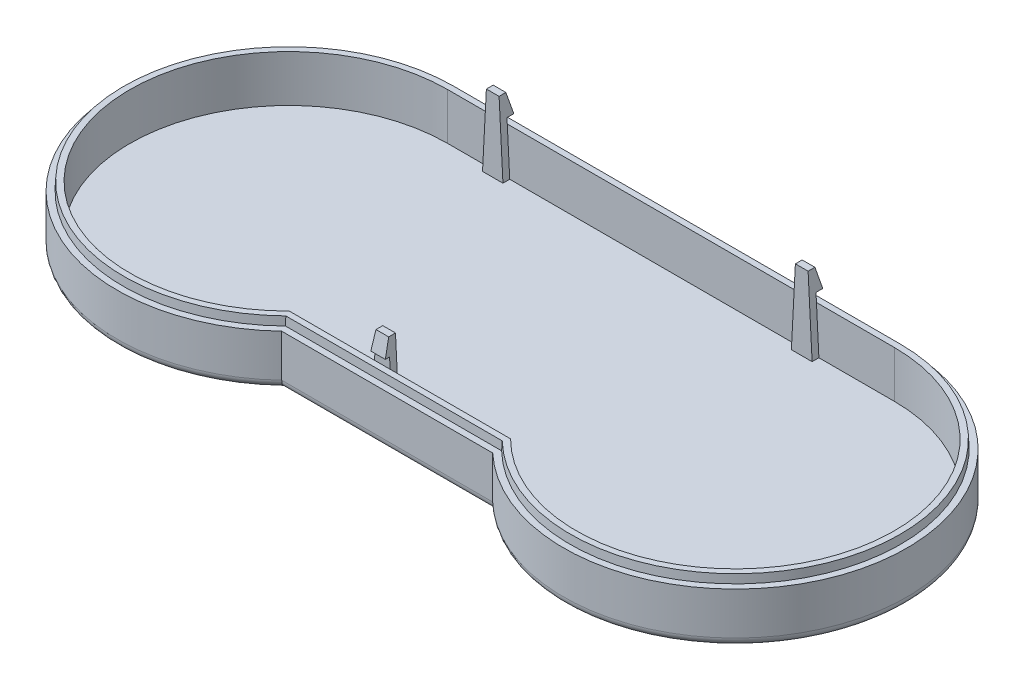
ISO-10303-21;
HEADER;
FILE_DESCRIPTION(('STEP AP214'),'2;1');
FILE_NAME('part.step','',(''),(''),'','','');
FILE_SCHEMA(('AUTOMOTIVE_DESIGN { 1 0 10303 214 1 1 1 1 }'));
ENDSEC;
DATA;
#1=APPLICATION_CONTEXT('core data for automotive mechanical design processes');
#2=APPLICATION_PROTOCOL_DEFINITION('international standard','automotive_design',2000,#1);
#3=PRODUCT_CONTEXT('',#1,'mechanical');
#4=PRODUCT('Part','Part','',(#3));
#5=PRODUCT_RELATED_PRODUCT_CATEGORY('part','',(#4));
#6=PRODUCT_DEFINITION_FORMATION('','',#4);
#7=PRODUCT_DEFINITION_CONTEXT('part definition',#1,'design');
#8=PRODUCT_DEFINITION('design','',#6,#7);
#9=PRODUCT_DEFINITION_SHAPE('','',#8);
#10=(LENGTH_UNIT() NAMED_UNIT(*) SI_UNIT(.MILLI.,.METRE.));
#11=(NAMED_UNIT(*) PLANE_ANGLE_UNIT() SI_UNIT($,.RADIAN.));
#12=(NAMED_UNIT(*) SI_UNIT($,.STERADIAN.) SOLID_ANGLE_UNIT());
#13=UNCERTAINTY_MEASURE_WITH_UNIT(LENGTH_MEASURE(1.E-05),#10,'distance_accuracy_value','');
#14=(GEOMETRIC_REPRESENTATION_CONTEXT(3) GLOBAL_UNCERTAINTY_ASSIGNED_CONTEXT((#13)) GLOBAL_UNIT_ASSIGNED_CONTEXT((#10,
#11,#12)) REPRESENTATION_CONTEXT('',''));
#15=CARTESIAN_POINT('',(0.,0.,0.));
#16=DIRECTION('',(0.,0.,1.));
#17=DIRECTION('',(1.,0.,0.));
#18=AXIS2_PLACEMENT_3D('',#15,#16,#17);
#19=CARTESIAN_POINT('',(-66.8305917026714,15.24,-47.5654461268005));
#20=DIRECTION('',(0.,0.,1.));
#21=DIRECTION('',(1.,0.,0.));
#22=AXIS2_PLACEMENT_3D('',#19,#20,#21);
#23=PLANE('',#22);
#24=DIRECTION('',(-0.0523359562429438,-0.998629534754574,0.));
#25=VECTOR('',#24,1.);
#26=CARTESIAN_POINT('',(-53.2218141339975,25.742282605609,-47.5654461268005));
#27=LINE('',#26,#25);
#28=CARTESIAN_POINT('',(-53.6390996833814,17.78,-47.5654461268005));
#29=VERTEX_POINT('',#28);
#30=CARTESIAN_POINT('',(-54.3712363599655,3.81,-47.5654461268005));
#31=VERTEX_POINT('',#30);
#32=EDGE_CURVE('E105',#29,#31,#27,.T.);
#33=ORIENTED_EDGE('',*,*,#32,.F.);
#34=DIRECTION('',(-1.,0.,0.));
#35=VECTOR('',#34,1.);
#36=CARTESIAN_POINT('',(-66.8305917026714,17.78,-47.5654461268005));
#37=LINE('',#36,#35);
#38=CARTESIAN_POINT('',(-66.8305917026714,17.78,-47.5654461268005));
#39=VERTEX_POINT('',#38);
#40=EDGE_CURVE('E528',#29,#39,#37,.T.);
#41=ORIENTED_EDGE('',*,*,#40,.T.);
#42=DIRECTION('',(0.,-1.,0.));
#43=VECTOR('',#42,1.);
#44=CARTESIAN_POINT('',(-66.8305917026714,15.24,-47.5654461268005));
#45=LINE('',#44,#43);
#46=CARTESIAN_POINT('',(-66.8305917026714,3.81,-47.5654461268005));
#47=VERTEX_POINT('',#46);
#48=EDGE_CURVE('E750',#39,#47,#45,.T.);
#49=ORIENTED_EDGE('',*,*,#48,.T.);
#50=DIRECTION('',(-1.,0.,0.));
#51=VECTOR('',#50,1.);
#52=CARTESIAN_POINT('',(-66.8305917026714,3.81,-47.5654461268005));
#53=LINE('',#52,#51);
#54=EDGE_CURVE('E330',#31,#47,#53,.T.);
#55=ORIENTED_EDGE('',*,*,#54,.F.);
#56=EDGE_LOOP('',(#33,#41,#49,#55));
#57=FACE_BOUND('',#56,.T.);
#58=ADVANCED_FACE('F88',(#57),#23,.T.);
#59=CARTESIAN_POINT('',(31.5685648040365,15.24,33.5534302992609));
#60=DIRECTION('',(0.,0.,-1.));
#61=DIRECTION('',(-1.,0.,0.));
#62=AXIS2_PLACEMENT_3D('',#59,#60,#61);
#63=PLANE('',#62);
#64=DIRECTION('',(0.0523359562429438,-0.998629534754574,0.));
#65=VECTOR('',#64,1.);
#66=CARTESIAN_POINT('',(-2.71383610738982,13.4433354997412,33.5534302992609));
#67=LINE('',#66,#65);
#68=CARTESIAN_POINT('',(-2.94111106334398,17.78,33.5534302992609));
#69=VERTEX_POINT('',#68);
#70=CARTESIAN_POINT('',(-2.20897438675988,3.81,33.5534302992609));
#71=VERTEX_POINT('',#70);
#72=EDGE_CURVE('E13',#69,#71,#67,.T.);
#73=ORIENTED_EDGE('',*,*,#72,.F.);
#74=DIRECTION('',(1.,0.,0.));
#75=VECTOR('',#74,1.);
#76=CARTESIAN_POINT('',(31.5685648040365,17.78,33.5534302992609));
#77=LINE('',#76,#75);
#78=CARTESIAN_POINT('',(33.1165148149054,17.78,33.5534302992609));
#79=VERTEX_POINT('',#78);
#80=EDGE_CURVE('E532',#69,#79,#77,.T.);
#81=ORIENTED_EDGE('',*,*,#80,.T.);
#82=DIRECTION('',(0.,-1.,0.));
#83=VECTOR('',#82,1.);
#84=CARTESIAN_POINT('',(33.1165148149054,15.24,33.5534302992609));
#85=LINE('',#84,#83);
#86=CARTESIAN_POINT('',(33.1165148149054,3.81,33.5534302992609));
#87=VERTEX_POINT('',#86);
#88=EDGE_CURVE('E744',#79,#87,#85,.T.);
#89=ORIENTED_EDGE('',*,*,#88,.T.);
#90=DIRECTION('',(1.,0.,0.));
#91=VECTOR('',#90,1.);
#92=CARTESIAN_POINT('',(31.5685648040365,3.81,33.5534302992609));
#93=LINE('',#92,#91);
#94=EDGE_CURVE('E745',#71,#87,#93,.T.);
#95=ORIENTED_EDGE('',*,*,#94,.F.);
#96=EDGE_LOOP('',(#73,#81,#89,#95));
#97=FACE_BOUND('',#96,.T.);
#98=ADVANCED_FACE('F610',(#97),#63,.T.);
#99=DIRECTION('',(-0.0523359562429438,0.998629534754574,0.));
#100=VECTOR('',#99,1.);
#101=CARTESIAN_POINT('',(-49.4118141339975,25.742282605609,-47.5654461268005));
#102=LINE('',#101,#100);
#103=CARTESIAN_POINT('',(-48.2623919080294,3.81,-47.5654461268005));
#104=VERTEX_POINT('',#103);
#105=CARTESIAN_POINT('',(-48.9945285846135,17.78,-47.5654461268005));
#106=VERTEX_POINT('',#105);
#107=EDGE_CURVE('E333',#104,#106,#102,.T.);
#108=ORIENTED_EDGE('',*,*,#107,.F.);
#109=CARTESIAN_POINT('',(38.0629201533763,3.81,-47.5654461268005));
#110=VERTEX_POINT('',#109);
#111=EDGE_CURVE('E318',#110,#104,#53,.T.);
#112=ORIENTED_EDGE('',*,*,#111,.F.);
#113=DIRECTION('',(-0.0523359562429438,-0.998629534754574,0.));
#114=VECTOR('',#113,1.);
#115=CARTESIAN_POINT('',(38.3729915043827,9.72651383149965,-47.5654461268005));
#116=LINE('',#115,#114);
#117=CARTESIAN_POINT('',(38.7950568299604,17.78,-47.5654461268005));
#118=VERTEX_POINT('',#117);
#119=EDGE_CURVE('E98',#118,#110,#116,.T.);
#120=ORIENTED_EDGE('',*,*,#119,.F.);
#121=EDGE_CURVE('E335',#118,#106,#37,.T.);
#122=ORIENTED_EDGE('',*,*,#121,.T.);
#123=EDGE_LOOP('',(#108,#112,#120,#122));
#124=FACE_BOUND('',#123,.T.);
#125=ADVANCED_FACE('F334',(#124),#23,.T.);
#126=CARTESIAN_POINT('',(66.8305917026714,15.24,0.));
#127=DIRECTION('',(0.,-1.,0.));
#128=DIRECTION('',(0.,0.,-1.));
#129=AXIS2_PLACEMENT_3D('',#126,#127,#128);
#130=CYLINDRICAL_SURFACE('',#129,51.3754461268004);
#131=DIRECTION('',(0.,-1.,0.));
#132=VECTOR('',#131,1.);
#133=CARTESIAN_POINT('',(31.5685648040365,15.24,37.3634302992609));
#134=LINE('',#133,#132);
#135=CARTESIAN_POINT('',(31.5685648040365,15.24,37.3634302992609));
#136=VERTEX_POINT('',#135);
#137=CARTESIAN_POINT('',(31.5685648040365,2.54,37.3634302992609));
#138=VERTEX_POINT('',#137);
#139=EDGE_CURVE('E723',#136,#138,#134,.T.);
#140=ORIENTED_EDGE('',*,*,#139,.T.);
#141=CARTESIAN_POINT('',(66.8305917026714,2.54,0.));
#142=DIRECTION('',(0.,1.,0.));
#143=DIRECTION('',(0.,0.,1.));
#144=AXIS2_PLACEMENT_3D('',#141,#142,#143);
#145=CIRCLE('',#144,51.3754461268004);
#146=CARTESIAN_POINT('',(66.8305917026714,2.54,-51.3754461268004));
#147=VERTEX_POINT('',#146);
#148=EDGE_CURVE('E668',#138,#147,#145,.T.);
#149=ORIENTED_EDGE('',*,*,#148,.T.);
#150=DIRECTION('',(0.,-1.,0.));
#151=VECTOR('',#150,1.);
#152=CARTESIAN_POINT('',(66.8305917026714,15.24,-51.3754461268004));
#153=LINE('',#152,#151);
#154=CARTESIAN_POINT('',(66.8305917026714,15.24,-51.3754461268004));
#155=VERTEX_POINT('',#154);
#156=EDGE_CURVE('E712',#155,#147,#153,.T.);
#157=ORIENTED_EDGE('',*,*,#156,.F.);
#158=CARTESIAN_POINT('',(66.8305917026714,15.24,0.));
#159=DIRECTION('',(0.,1.,0.));
#160=DIRECTION('',(0.,0.,1.));
#161=AXIS2_PLACEMENT_3D('',#158,#159,#160);
#162=CIRCLE('',#161,51.3754461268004);
#163=EDGE_CURVE('E735',#136,#155,#162,.T.);
#164=ORIENTED_EDGE('',*,*,#163,.F.);
#165=EDGE_LOOP('',(#140,#149,#157,#164));
#166=FACE_BOUND('',#165,.T.);
#167=ADVANCED_FACE('F633',(#166),#130,.T.);
#168=CARTESIAN_POINT('',(-66.8305917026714,15.24,-51.3754461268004));
#169=DIRECTION('',(0.,0.,1.));
#170=DIRECTION('',(1.,0.,0.));
#171=AXIS2_PLACEMENT_3D('',#168,#169,#170);
#172=PLANE('',#171);
#173=ORIENTED_EDGE('',*,*,#156,.T.);
#174=DIRECTION('',(-1.,0.,0.));
#175=VECTOR('',#174,1.);
#176=CARTESIAN_POINT('',(-66.8305917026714,2.54,-51.3754461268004));
#177=LINE('',#176,#175);
#178=CARTESIAN_POINT('',(-66.8305917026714,2.54,-51.3754461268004));
#179=VERTEX_POINT('',#178);
#180=EDGE_CURVE('E692',#147,#179,#177,.T.);
#181=ORIENTED_EDGE('',*,*,#180,.T.);
#182=DIRECTION('',(0.,-1.,0.));
#183=VECTOR('',#182,1.);
#184=CARTESIAN_POINT('',(-66.8305917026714,15.24,-51.3754461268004));
#185=LINE('',#184,#183);
#186=CARTESIAN_POINT('',(-66.8305917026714,15.24,-51.3754461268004));
#187=VERTEX_POINT('',#186);
#188=EDGE_CURVE('E715',#187,#179,#185,.T.);
#189=ORIENTED_EDGE('',*,*,#188,.F.);
#190=DIRECTION('',(-1.,0.,0.));
#191=VECTOR('',#190,1.);
#192=CARTESIAN_POINT('',(-66.8305917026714,15.24,-51.3754461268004));
#193=LINE('',#192,#191);
#194=EDGE_CURVE('E732',#155,#187,#193,.T.);
#195=ORIENTED_EDGE('',*,*,#194,.F.);
#196=EDGE_LOOP('',(#173,#181,#189,#195));
#197=FACE_BOUND('',#196,.T.);
#198=ADVANCED_FACE('F629',(#197),#172,.F.);
#199=CARTESIAN_POINT('',(-66.8305917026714,15.24,0.));
#200=DIRECTION('',(0.,-1.,0.));
#201=DIRECTION('',(0.,0.,-1.));
#202=AXIS2_PLACEMENT_3D('',#199,#200,#201);
#203=CYLINDRICAL_SURFACE('',#202,51.3754461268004);
#204=ORIENTED_EDGE('',*,*,#188,.T.);
#205=CARTESIAN_POINT('',(-66.8305917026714,2.54,0.));
#206=DIRECTION('',(0.,1.,0.));
#207=DIRECTION('',(0.,0.,1.));
#208=AXIS2_PLACEMENT_3D('',#205,#206,#207);
#209=CIRCLE('',#208,51.3754461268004);
#210=CARTESIAN_POINT('',(-31.5685648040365,2.54,37.3634302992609));
#211=VERTEX_POINT('',#210);
#212=EDGE_CURVE('E678',#179,#211,#209,.T.);
#213=ORIENTED_EDGE('',*,*,#212,.T.);
#214=DIRECTION('',(0.,-1.,0.));
#215=VECTOR('',#214,1.);
#216=CARTESIAN_POINT('',(-31.5685648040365,15.24,37.3634302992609));
#217=LINE('',#216,#215);
#218=CARTESIAN_POINT('',(-31.5685648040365,15.24,37.3634302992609));
#219=VERTEX_POINT('',#218);
#220=EDGE_CURVE('E719',#219,#211,#217,.T.);
#221=ORIENTED_EDGE('',*,*,#220,.F.);
#222=CARTESIAN_POINT('',(-66.8305917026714,15.24,0.));
#223=DIRECTION('',(0.,1.,0.));
#224=DIRECTION('',(0.,0.,1.));
#225=AXIS2_PLACEMENT_3D('',#222,#223,#224);
#226=CIRCLE('',#225,51.3754461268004);
#227=EDGE_CURVE('E729',#187,#219,#226,.T.);
#228=ORIENTED_EDGE('',*,*,#227,.F.);
#229=EDGE_LOOP('',(#204,#213,#221,#228));
#230=FACE_BOUND('',#229,.T.);
#231=ADVANCED_FACE('F625',(#230),#203,.T.);
#232=CARTESIAN_POINT('',(31.5685648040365,15.24,37.3634302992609));
#233=DIRECTION('',(0.,0.,-1.));
#234=DIRECTION('',(-1.,0.,0.));
#235=AXIS2_PLACEMENT_3D('',#232,#233,#234);
#236=PLANE('',#235);
#237=ORIENTED_EDGE('',*,*,#220,.T.);
#238=DIRECTION('',(1.,0.,0.));
#239=VECTOR('',#238,1.);
#240=CARTESIAN_POINT('',(31.5685648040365,2.54,37.3634302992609));
#241=LINE('',#240,#239);
#242=EDGE_CURVE('E671',#211,#138,#241,.T.);
#243=ORIENTED_EDGE('',*,*,#242,.T.);
#244=ORIENTED_EDGE('',*,*,#139,.F.);
#245=DIRECTION('',(1.,0.,0.));
#246=VECTOR('',#245,1.);
#247=CARTESIAN_POINT('',(31.5685648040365,15.24,37.3634302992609));
#248=LINE('',#247,#246);
#249=EDGE_CURVE('E726',#219,#136,#248,.T.);
#250=ORIENTED_EDGE('',*,*,#249,.F.);
#251=EDGE_LOOP('',(#237,#243,#244,#250));
#252=FACE_BOUND('',#251,.T.);
#253=ADVANCED_FACE('F617',(#252),#236,.F.);
#254=CARTESIAN_POINT('',(66.8305917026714,15.24,0.));
#255=DIRECTION('',(0.,1.,0.));
#256=DIRECTION('',(0.,0.,1.));
#257=AXIS2_PLACEMENT_3D('',#254,#255,#256);
#258=PLANE('',#257);
#259=DIRECTION('',(-1.,0.,0.));
#260=VECTOR('',#259,1.);
#261=CARTESIAN_POINT('',(66.8305917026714,15.24,35.4584302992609));
#262=LINE('',#261,#260);
#263=CARTESIAN_POINT('',(32.3338561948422,15.24,35.4584302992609));
#264=VERTEX_POINT('',#263);
#265=CARTESIAN_POINT('',(-32.3338561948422,15.24,35.4584302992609));
#266=VERTEX_POINT('',#265);
#267=EDGE_CURVE('E546',#264,#266,#262,.T.);
#268=ORIENTED_EDGE('',*,*,#267,.T.);
#269=CARTESIAN_POINT('',(-66.8305917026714,15.24,0.));
#270=DIRECTION('',(0.,1.,0.));
#271=DIRECTION('',(0.,0.,1.));
#272=AXIS2_PLACEMENT_3D('',#269,#270,#271);
#273=CIRCLE('',#272,49.4704461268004);
#274=CARTESIAN_POINT('',(-66.8305917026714,15.24,-49.4704461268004));
#275=VERTEX_POINT('',#274);
#276=EDGE_CURVE('E542',#266,#275,#273,.F.);
#277=ORIENTED_EDGE('',*,*,#276,.T.);
#278=DIRECTION('',(1.,0.,0.));
#279=VECTOR('',#278,1.);
#280=CARTESIAN_POINT('',(66.8305917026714,15.24,-49.4704461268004));
#281=LINE('',#280,#279);
#282=CARTESIAN_POINT('',(66.8305917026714,15.24,-49.4704461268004));
#283=VERTEX_POINT('',#282);
#284=EDGE_CURVE('E522',#275,#283,#281,.T.);
#285=ORIENTED_EDGE('',*,*,#284,.T.);
#286=CARTESIAN_POINT('',(66.8305917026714,15.24,0.));
#287=DIRECTION('',(0.,1.,0.));
#288=DIRECTION('',(0.,0.,1.));
#289=AXIS2_PLACEMENT_3D('',#286,#287,#288);
#290=CIRCLE('',#289,49.4704461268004);
#291=EDGE_CURVE('E545',#283,#264,#290,.F.);
#292=ORIENTED_EDGE('',*,*,#291,.T.);
#293=EDGE_LOOP('',(#268,#277,#285,#292));
#294=FACE_BOUND('',#293,.T.);
#295=ORIENTED_EDGE('',*,*,#163,.T.);
#296=ORIENTED_EDGE('',*,*,#194,.T.);
#297=ORIENTED_EDGE('',*,*,#227,.T.);
#298=ORIENTED_EDGE('',*,*,#249,.T.);
#299=EDGE_LOOP('',(#295,#296,#297,#298));
#300=FACE_BOUND('',#299,.T.);
#301=ADVANCED_FACE('F613',(#294,#300),#258,.T.);
#302=CARTESIAN_POINT('',(66.8305917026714,0.,0.));
#303=DIRECTION('',(0.,1.,0.));
#304=DIRECTION('',(0.,0.,1.));
#305=AXIS2_PLACEMENT_3D('',#302,#303,#304);
#306=PLANE('',#305);
#307=CARTESIAN_POINT('',(-66.8305917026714,0.,0.));
#308=DIRECTION('',(0.,1.,0.));
#309=DIRECTION('',(0.,0.,1.));
#310=AXIS2_PLACEMENT_3D('',#307,#308,#309);
#311=CIRCLE('',#310,48.8354461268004);
#312=CARTESIAN_POINT('',(-32.5927544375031,0.,34.8234302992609));
#313=VERTEX_POINT('',#312);
#314=CARTESIAN_POINT('',(-66.8305917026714,0.,-48.8354461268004));
#315=VERTEX_POINT('',#314);
#316=EDGE_CURVE('E701',#313,#315,#311,.F.);
#317=ORIENTED_EDGE('',*,*,#316,.T.);
#318=DIRECTION('',(-1.,0.,0.));
#319=VECTOR('',#318,1.);
#320=CARTESIAN_POINT('',(66.8305917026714,0.,-48.8354461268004));
#321=LINE('',#320,#319);
#322=CARTESIAN_POINT('',(66.8305917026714,0.,-48.8354461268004));
#323=VERTEX_POINT('',#322);
#324=EDGE_CURVE('E690',#315,#323,#321,.F.);
#325=ORIENTED_EDGE('',*,*,#324,.T.);
#326=CARTESIAN_POINT('',(66.8305917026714,0.,0.));
#327=DIRECTION('',(0.,1.,0.));
#328=DIRECTION('',(0.,0.,1.));
#329=AXIS2_PLACEMENT_3D('',#326,#327,#328);
#330=CIRCLE('',#329,48.8354461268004);
#331=CARTESIAN_POINT('',(32.5927544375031,0.,34.8234302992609));
#332=VERTEX_POINT('',#331);
#333=EDGE_CURVE('E694',#323,#332,#330,.F.);
#334=ORIENTED_EDGE('',*,*,#333,.T.);
#335=DIRECTION('',(1.,0.,0.));
#336=VECTOR('',#335,1.);
#337=CARTESIAN_POINT('',(66.8305917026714,0.,34.8234302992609));
#338=LINE('',#337,#336);
#339=EDGE_CURVE('E698',#332,#313,#338,.F.);
#340=ORIENTED_EDGE('',*,*,#339,.T.);
#341=EDGE_LOOP('',(#317,#325,#334,#340));
#342=FACE_BOUND('',#341,.T.);
#343=ADVANCED_FACE('F616',(#342),#306,.F.);
#344=CARTESIAN_POINT('',(31.5685648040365,2.54,34.8234302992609));
#345=DIRECTION('',(1.,0.,0.));
#346=DIRECTION('',(0.,0.,-1.));
#347=AXIS2_PLACEMENT_3D('',#344,#345,#346);
#348=CYLINDRICAL_SURFACE('',#347,2.54);
#349=CARTESIAN_POINT('',(-31.5685648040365,2.54,37.3634302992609));
#350=CARTESIAN_POINT('',(-31.5685613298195,2.47222698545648,37.3634395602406));
#351=CARTESIAN_POINT('',(-31.5696426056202,2.40445875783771,37.3607179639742));
#352=CARTESIAN_POINT('',(-31.5739479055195,2.26943554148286,37.3498841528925));
#353=CARTESIAN_POINT('',(-31.5771715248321,2.20218045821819,37.3417729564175));
#354=CARTESIAN_POINT('',(-31.5857237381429,2.06883336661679,37.32025876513));
#355=CARTESIAN_POINT('',(-31.59104688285,2.00273880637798,37.3068694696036));
#356=CARTESIAN_POINT('',(-31.6037418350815,1.87202254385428,37.274948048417));
#357=CARTESIAN_POINT('',(-31.6111136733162,1.80740086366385,37.2564158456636));
#358=CARTESIAN_POINT('',(-31.6362059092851,1.61644789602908,37.1933607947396));
#359=CARTESIAN_POINT('',(-31.6569127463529,1.49287911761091,37.1413550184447));
#360=CARTESIAN_POINT('',(-31.7055405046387,1.25658190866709,37.0193717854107));
#361=CARTESIAN_POINT('',(-31.7334637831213,1.14385703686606,36.9493884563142));
#362=CARTESIAN_POINT('',(-31.7965280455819,0.928683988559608,36.7915659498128));
#363=CARTESIAN_POINT('',(-31.8318531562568,0.826623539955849,36.70327200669));
#364=CARTESIAN_POINT('',(-31.9081261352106,0.638693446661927,36.5129676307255));
#365=CARTESIAN_POINT('',(-31.9490757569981,0.552828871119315,36.4109529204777));
#366=CARTESIAN_POINT('',(-32.0383922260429,0.39360021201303,36.18888411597));
#367=CARTESIAN_POINT('',(-32.0870723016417,0.321460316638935,36.0680791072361));
#368=CARTESIAN_POINT('',(-32.188261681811,0.198456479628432,35.8175403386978));
#369=CARTESIAN_POINT('',(-32.2407722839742,0.147599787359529,35.6878035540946));
#370=CARTESIAN_POINT('',(-32.3421388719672,0.0724115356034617,35.4379602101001));
#371=CARTESIAN_POINT('',(-32.3907279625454,0.0457150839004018,35.318444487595));
#372=CARTESIAN_POINT('',(-32.4889295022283,0.00980575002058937,35.0774216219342));
#373=CARTESIAN_POINT('',(-32.5385396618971,0.000557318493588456,34.9559190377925));
#374=CARTESIAN_POINT('',(-32.589714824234,8.12581831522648E-06,34.8308577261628));
#375=CARTESIAN_POINT('',(-32.5912346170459,-1.95160637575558E-08,34.8271439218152));
#376=CARTESIAN_POINT('',(-32.5927544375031,0.,34.8234302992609));
#377=B_SPLINE_CURVE_WITH_KNOTS('',3,(#349,#350,#351,#352,#353,#354,#355,#356,#357,#358,#359,
#360,#361,#362,#363,#364,#365,#366,#367,#368,#369,#370,#371,#372,#373,#374,#375,#376),
.UNSPECIFIED.,.F.,.F.,(4,2,2,2,2,2,2,2,2,2,2,2,2,4),(0.,0.203247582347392,0.406456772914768,
0.609141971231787,0.811830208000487,1.21675684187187,1.62181591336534,2.03849864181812,
2.45531157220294,2.90007195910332,3.34498371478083,3.73911707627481,4.13244654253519,
4.14448475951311),.UNSPECIFIED.);
#378=EDGE_CURVE('E648',#313,#211,#377,.F.);
#379=ORIENTED_EDGE('',*,*,#378,.F.);
#380=ORIENTED_EDGE('',*,*,#339,.F.);
#381=CARTESIAN_POINT('',(31.5685648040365,2.54,37.3634302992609));
#382=CARTESIAN_POINT('',(31.5685613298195,2.47222698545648,37.3634395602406));
#383=CARTESIAN_POINT('',(31.5696426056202,2.40445875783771,37.3607179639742));
#384=CARTESIAN_POINT('',(31.5739479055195,2.26943554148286,37.3498841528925));
#385=CARTESIAN_POINT('',(31.5771715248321,2.20218045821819,37.3417729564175));
#386=CARTESIAN_POINT('',(31.5857237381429,2.06883336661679,37.32025876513));
#387=CARTESIAN_POINT('',(31.59104688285,2.00273880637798,37.3068694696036));
#388=CARTESIAN_POINT('',(31.6037418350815,1.87202254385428,37.274948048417));
#389=CARTESIAN_POINT('',(31.6111136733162,1.80740086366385,37.2564158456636));
#390=CARTESIAN_POINT('',(31.6362059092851,1.61644789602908,37.1933607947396));
#391=CARTESIAN_POINT('',(31.6569127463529,1.49287911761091,37.1413550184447));
#392=CARTESIAN_POINT('',(31.7055405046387,1.25658190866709,37.0193717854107));
#393=CARTESIAN_POINT('',(31.7334637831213,1.14385703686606,36.9493884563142));
#394=CARTESIAN_POINT('',(31.7965280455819,0.928683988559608,36.7915659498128));
#395=CARTESIAN_POINT('',(31.8318531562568,0.826623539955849,36.70327200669));
#396=CARTESIAN_POINT('',(31.9081261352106,0.638693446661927,36.5129676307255));
#397=CARTESIAN_POINT('',(31.9490757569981,0.552828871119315,36.4109529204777));
#398=CARTESIAN_POINT('',(32.0383922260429,0.39360021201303,36.18888411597));
#399=CARTESIAN_POINT('',(32.0870723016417,0.321460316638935,36.0680791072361));
#400=CARTESIAN_POINT('',(32.188261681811,0.198456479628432,35.8175403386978));
#401=CARTESIAN_POINT('',(32.2407722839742,0.147599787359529,35.6878035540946));
#402=CARTESIAN_POINT('',(32.3421388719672,0.0724115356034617,35.4379602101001));
#403=CARTESIAN_POINT('',(32.3907279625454,0.0457150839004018,35.318444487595));
#404=CARTESIAN_POINT('',(32.4889295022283,0.00980575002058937,35.0774216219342));
#405=CARTESIAN_POINT('',(32.5385396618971,0.000557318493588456,34.9559190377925));
#406=CARTESIAN_POINT('',(32.589714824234,8.12581831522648E-06,34.8308577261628));
#407=CARTESIAN_POINT('',(32.5912346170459,-1.95160637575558E-08,34.8271439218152));
#408=CARTESIAN_POINT('',(32.5927544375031,0.,34.8234302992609));
#409=B_SPLINE_CURVE_WITH_KNOTS('',3,(#381,#382,#383,#384,#385,#386,#387,#388,#389,#390,#391,
#392,#393,#394,#395,#396,#397,#398,#399,#400,#401,#402,#403,#404,#405,#406,#407,#408),
.UNSPECIFIED.,.F.,.F.,(4,2,2,2,2,2,2,2,2,2,2,2,2,4),(0.,0.203247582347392,0.406456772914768,
0.609141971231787,0.811830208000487,1.21675684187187,1.62181591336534,2.03849864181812,
2.45531157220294,2.90007195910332,3.34498371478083,3.73911707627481,4.13244654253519,
4.14448475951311),.UNSPECIFIED.);
#410=EDGE_CURVE('E657',#138,#332,#409,.T.);
#411=ORIENTED_EDGE('',*,*,#410,.F.);
#412=ORIENTED_EDGE('',*,*,#242,.F.);
#413=EDGE_LOOP('',(#379,#380,#411,#412));
#414=FACE_BOUND('',#413,.T.);
#415=ADVANCED_FACE('F621',(#414),#348,.T.);
#416=CARTESIAN_POINT('',(66.8305917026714,2.54,0.));
#417=DIRECTION('',(0.,1.,0.));
#418=DIRECTION('',(0.,0.,1.));
#419=AXIS2_PLACEMENT_3D('',#416,#417,#418);
#420=TOROIDAL_SURFACE('',#419,48.8354461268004,2.54);
#421=ORIENTED_EDGE('',*,*,#410,.T.);
#422=ORIENTED_EDGE('',*,*,#333,.F.);
#423=CARTESIAN_POINT('',(66.8305917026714,2.54,-48.8354461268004));
#424=DIRECTION('',(-1.,0.,0.));
#425=DIRECTION('',(0.,0.,1.));
#426=AXIS2_PLACEMENT_3D('',#423,#424,#425);
#427=CIRCLE('',#426,2.54);
#428=EDGE_CURVE('E658',#147,#323,#427,.T.);
#429=ORIENTED_EDGE('',*,*,#428,.F.);
#430=ORIENTED_EDGE('',*,*,#148,.F.);
#431=EDGE_LOOP('',(#421,#422,#429,#430));
#432=FACE_BOUND('',#431,.T.);
#433=ADVANCED_FACE('F90',(#432),#420,.T.);
#434=CARTESIAN_POINT('',(-66.8305917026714,2.54,0.));
#435=DIRECTION('',(0.,1.,0.));
#436=DIRECTION('',(0.,0.,1.));
#437=AXIS2_PLACEMENT_3D('',#434,#435,#436);
#438=TOROIDAL_SURFACE('',#437,48.8354461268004,2.54);
#439=ORIENTED_EDGE('',*,*,#378,.T.);
#440=ORIENTED_EDGE('',*,*,#212,.F.);
#441=CARTESIAN_POINT('',(-66.8305917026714,2.54,-48.8354461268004));
#442=DIRECTION('',(1.,0.,0.));
#443=DIRECTION('',(0.,0.,-1.));
#444=AXIS2_PLACEMENT_3D('',#441,#442,#443);
#445=CIRCLE('',#444,2.54);
#446=EDGE_CURVE('E569',#315,#179,#445,.T.);
#447=ORIENTED_EDGE('',*,*,#446,.F.);
#448=ORIENTED_EDGE('',*,*,#316,.F.);
#449=EDGE_LOOP('',(#439,#440,#447,#448));
#450=FACE_BOUND('',#449,.T.);
#451=ADVANCED_FACE('F641',(#450),#438,.T.);
#452=CARTESIAN_POINT('',(-66.8305917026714,2.54,-48.8354461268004));
#453=DIRECTION('',(-1.,0.,0.));
#454=DIRECTION('',(0.,0.,1.));
#455=AXIS2_PLACEMENT_3D('',#452,#453,#454);
#456=CYLINDRICAL_SURFACE('',#455,2.54);
#457=ORIENTED_EDGE('',*,*,#428,.T.);
#458=ORIENTED_EDGE('',*,*,#324,.F.);
#459=ORIENTED_EDGE('',*,*,#446,.T.);
#460=ORIENTED_EDGE('',*,*,#180,.F.);
#461=EDGE_LOOP('',(#457,#458,#459,#460));
#462=FACE_BOUND('',#461,.T.);
#463=ADVANCED_FACE('F638',(#462),#456,.T.);
#464=CARTESIAN_POINT('',(66.8305917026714,15.24,35.4584302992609));
#465=DIRECTION('',(0.,0.0523359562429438,0.998629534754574));
#466=DIRECTION('',(0.,-0.998629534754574,0.0523359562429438));
#467=AXIS2_PLACEMENT_3D('',#464,#465,#466);
#468=PLANE('',#467);
#469=ORIENTED_EDGE('',*,*,#267,.F.);
#470=CARTESIAN_POINT('',(32.3879681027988,17.78,35.3253145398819));
#471=CARTESIAN_POINT('',(32.3789423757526,17.3566668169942,35.3475004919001));
#472=CARTESIAN_POINT('',(32.3699201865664,16.9333335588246,35.3696864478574));
#473=CARTESIAN_POINT('',(32.3518828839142,16.0866668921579,35.4140583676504));
#474=CARTESIAN_POINT('',(32.3428677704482,15.6633334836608,35.436244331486));
#475=CARTESIAN_POINT('',(32.3338561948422,15.24,35.4584302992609));
#476=B_SPLINE_CURVE_WITH_KNOTS('',3,(#470,#471,#472,#473,#474,#475),.UNSPECIFIED.,.F.,.F.,(4,2,
4),(0.,1.27203065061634,2.54406130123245),.UNSPECIFIED.);
#477=CARTESIAN_POINT('',(32.3879681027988,17.78,35.3253145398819));
#478=VERTEX_POINT('',#477);
#479=EDGE_CURVE('E558',#478,#264,#476,.T.);
#480=ORIENTED_EDGE('',*,*,#479,.F.);
#481=DIRECTION('',(-1.,0.,0.));
#482=VECTOR('',#481,1.);
#483=CARTESIAN_POINT('',(66.8305917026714,17.78,35.3253145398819));
#484=LINE('',#483,#482);
#485=CARTESIAN_POINT('',(-32.3879681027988,17.78,35.3253145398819));
#486=VERTEX_POINT('',#485);
#487=EDGE_CURVE('E768',#478,#486,#484,.T.);
#488=ORIENTED_EDGE('',*,*,#487,.T.);
#489=CARTESIAN_POINT('',(-32.3879681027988,17.78,35.3253145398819));
#490=CARTESIAN_POINT('',(-32.3789423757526,17.3566668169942,35.3475004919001));
#491=CARTESIAN_POINT('',(-32.3699201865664,16.9333335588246,35.3696864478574));
#492=CARTESIAN_POINT('',(-32.3518828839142,16.0866668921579,35.4140583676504));
#493=CARTESIAN_POINT('',(-32.3428677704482,15.6633334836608,35.436244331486));
#494=CARTESIAN_POINT('',(-32.3338561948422,15.24,35.4584302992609));
#495=B_SPLINE_CURVE_WITH_KNOTS('',3,(#489,#490,#491,#492,#493,#494),.UNSPECIFIED.,.F.,.F.,(4,2,
4),(0.,1.27203065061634,2.54406130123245),.UNSPECIFIED.);
#496=EDGE_CURVE('E541',#486,#266,#495,.T.);
#497=ORIENTED_EDGE('',*,*,#496,.T.);
#498=EDGE_LOOP('',(#469,#480,#488,#497));
#499=FACE_BOUND('',#498,.T.);
#500=ADVANCED_FACE('F576',(#499),#468,.T.);
#501=CARTESIAN_POINT('',(66.8305917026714,15.24,0.));
#502=DIRECTION('',(0.,-1.,0.));
#503=DIRECTION('',(0.,0.,1.));
#504=AXIS2_PLACEMENT_3D('',#501,#502,#503);
#505=CONICAL_SURFACE('',#504,49.4704461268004,0.0523598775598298);
#506=ORIENTED_EDGE('',*,*,#291,.F.);
#507=DIRECTION('',(0.,-0.998629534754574,-0.0523359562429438));
#508=VECTOR('',#507,1.);
#509=CARTESIAN_POINT('',(66.8305917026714,15.24,-49.4704461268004));
#510=LINE('',#509,#508);
#511=CARTESIAN_POINT('',(66.8305917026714,17.78,-49.3373303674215));
#512=VERTEX_POINT('',#511);
#513=EDGE_CURVE('E554',#512,#283,#510,.T.);
#514=ORIENTED_EDGE('',*,*,#513,.F.);
#515=CARTESIAN_POINT('',(66.8305917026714,17.78,0.));
#516=DIRECTION('',(0.,1.,0.));
#517=DIRECTION('',(0.,0.,1.));
#518=AXIS2_PLACEMENT_3D('',#515,#516,#517);
#519=CIRCLE('',#518,49.3373303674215);
#520=EDGE_CURVE('E776',#512,#478,#519,.F.);
#521=ORIENTED_EDGE('',*,*,#520,.T.);
#522=ORIENTED_EDGE('',*,*,#479,.T.);
#523=EDGE_LOOP('',(#506,#514,#521,#522));
#524=FACE_BOUND('',#523,.T.);
#525=ADVANCED_FACE('F579',(#524),#505,.T.);
#526=CARTESIAN_POINT('',(66.8305917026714,15.24,-49.4704461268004));
#527=DIRECTION('',(0.,0.0523359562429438,-0.998629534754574));
#528=DIRECTION('',(0.,0.998629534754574,0.0523359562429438));
#529=AXIS2_PLACEMENT_3D('',#526,#527,#528);
#530=PLANE('',#529);
#531=ORIENTED_EDGE('',*,*,#284,.F.);
#532=DIRECTION('',(0.,-0.998629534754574,-0.0523359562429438));
#533=VECTOR('',#532,1.);
#534=CARTESIAN_POINT('',(-66.8305917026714,15.24,-49.4704461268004));
#535=LINE('',#534,#533);
#536=CARTESIAN_POINT('',(-66.8305917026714,17.78,-49.3373303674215));
#537=VERTEX_POINT('',#536);
#538=EDGE_CURVE('E559',#537,#275,#535,.T.);
#539=ORIENTED_EDGE('',*,*,#538,.F.);
#540=DIRECTION('',(1.,0.,0.));
#541=VECTOR('',#540,1.);
#542=CARTESIAN_POINT('',(66.8305917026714,17.78,-49.3373303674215));
#543=LINE('',#542,#541);
#544=EDGE_CURVE('E551',#537,#512,#543,.T.);
#545=ORIENTED_EDGE('',*,*,#544,.T.);
#546=ORIENTED_EDGE('',*,*,#513,.T.);
#547=EDGE_LOOP('',(#531,#539,#545,#546));
#548=FACE_BOUND('',#547,.T.);
#549=ADVANCED_FACE('F582',(#548),#530,.T.);
#550=CARTESIAN_POINT('',(-66.8305917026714,15.24,0.));
#551=DIRECTION('',(0.,-1.,0.));
#552=DIRECTION('',(0.,0.,1.));
#553=AXIS2_PLACEMENT_3D('',#550,#551,#552);
#554=CONICAL_SURFACE('',#553,49.4704461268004,0.0523598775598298);
#555=ORIENTED_EDGE('',*,*,#276,.F.);
#556=ORIENTED_EDGE('',*,*,#496,.F.);
#557=CARTESIAN_POINT('',(-66.8305917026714,17.78,0.));
#558=DIRECTION('',(0.,1.,0.));
#559=DIRECTION('',(0.,0.,1.));
#560=AXIS2_PLACEMENT_3D('',#557,#558,#559);
#561=CIRCLE('',#560,49.3373303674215);
#562=EDGE_CURVE('E772',#486,#537,#561,.F.);
#563=ORIENTED_EDGE('',*,*,#562,.T.);
#564=ORIENTED_EDGE('',*,*,#538,.T.);
#565=EDGE_LOOP('',(#555,#556,#563,#564));
#566=FACE_BOUND('',#565,.T.);
#567=ADVANCED_FACE('F584',(#566),#554,.T.);
#568=CARTESIAN_POINT('',(66.8305917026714,17.78,0.));
#569=DIRECTION('',(0.,1.,0.));
#570=DIRECTION('',(0.,0.,1.));
#571=AXIS2_PLACEMENT_3D('',#568,#569,#570);
#572=PLANE('',#571);
#573=ORIENTED_EDGE('',*,*,#487,.F.);
#574=ORIENTED_EDGE('',*,*,#520,.F.);
#575=ORIENTED_EDGE('',*,*,#544,.F.);
#576=ORIENTED_EDGE('',*,*,#562,.F.);
#577=EDGE_LOOP('',(#573,#574,#575,#576));
#578=FACE_BOUND('',#577,.T.);
#579=CARTESIAN_POINT('',(66.8305917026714,17.78,0.));
#580=DIRECTION('',(0.,1.,0.));
#581=DIRECTION('',(0.,0.,1.));
#582=AXIS2_PLACEMENT_3D('',#579,#580,#581);
#583=CIRCLE('',#582,47.5654461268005);
#584=CARTESIAN_POINT('',(66.8305917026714,17.78,-47.5654461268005));
#585=VERTEX_POINT('',#584);
#586=EDGE_CURVE('E536',#79,#585,#583,.T.);
#587=ORIENTED_EDGE('',*,*,#586,.F.);
#588=ORIENTED_EDGE('',*,*,#80,.F.);
#589=CARTESIAN_POINT('',(-7.60925368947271,17.78,33.5534302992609));
#590=VERTEX_POINT('',#589);
#591=EDGE_CURVE('E537',#590,#69,#77,.T.);
#592=ORIENTED_EDGE('',*,*,#591,.F.);
#593=CARTESIAN_POINT('',(-33.1165148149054,17.78,33.5534302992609));
#594=VERTEX_POINT('',#593);
#595=EDGE_CURVE('E533',#594,#590,#77,.T.);
#596=ORIENTED_EDGE('',*,*,#595,.F.);
#597=CARTESIAN_POINT('',(-66.8305917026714,17.78,0.));
#598=DIRECTION('',(0.,1.,0.));
#599=DIRECTION('',(0.,0.,1.));
#600=AXIS2_PLACEMENT_3D('',#597,#598,#599);
#601=CIRCLE('',#600,47.5654461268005);
#602=EDGE_CURVE('E526',#39,#594,#601,.T.);
#603=ORIENTED_EDGE('',*,*,#602,.F.);
#604=ORIENTED_EDGE('',*,*,#40,.F.);
#605=DIRECTION('',(-1.,0.,0.));
#606=VECTOR('',#605,1.);
#607=CARTESIAN_POINT('',(66.8305917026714,17.78,-47.5654461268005));
#608=LINE('',#607,#606);
#609=EDGE_CURVE('E112',#106,#29,#608,.T.);
#610=ORIENTED_EDGE('',*,*,#609,.F.);
#611=ORIENTED_EDGE('',*,*,#121,.F.);
#612=CARTESIAN_POINT('',(43.5368671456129,17.78,-47.5654461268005));
#613=VERTEX_POINT('',#612);
#614=EDGE_CURVE('E527',#613,#118,#37,.T.);
#615=ORIENTED_EDGE('',*,*,#614,.F.);
#616=EDGE_CURVE('E523',#585,#613,#37,.T.);
#617=ORIENTED_EDGE('',*,*,#616,.F.);
#618=EDGE_LOOP('',(#587,#588,#592,#596,#603,#604,#610,#611,#615,#617));
#619=FACE_BOUND('',#618,.T.);
#620=ADVANCED_FACE('F588',(#578,#619),#572,.T.);
#621=CARTESIAN_POINT('',(66.8305917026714,3.81,0.));
#622=DIRECTION('',(0.,1.,0.));
#623=DIRECTION('',(0.,0.,1.));
#624=AXIS2_PLACEMENT_3D('',#621,#622,#623);
#625=PLANE('',#624);
#626=DIRECTION('',(0.,0.,-1.));
#627=VECTOR('',#626,1.);
#628=CARTESIAN_POINT('',(-54.3712363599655,3.81,-45.5334461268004));
#629=LINE('',#628,#627);
#630=CARTESIAN_POINT('',(-54.3712363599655,3.81,-45.5334461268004));
#631=VERTEX_POINT('',#630);
#632=EDGE_CURVE('E339',#631,#31,#629,.T.);
#633=ORIENTED_EDGE('',*,*,#632,.T.);
#634=ORIENTED_EDGE('',*,*,#54,.T.);
#635=CARTESIAN_POINT('',(-66.8305917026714,3.81,0.));
#636=DIRECTION('',(0.,1.,0.));
#637=DIRECTION('',(0.,0.,1.));
#638=AXIS2_PLACEMENT_3D('',#635,#636,#637);
#639=CIRCLE('',#638,47.5654461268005);
#640=CARTESIAN_POINT('',(-33.1165148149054,3.81,33.5534302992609));
#641=VERTEX_POINT('',#640);
#642=EDGE_CURVE('E751',#47,#641,#639,.T.);
#643=ORIENTED_EDGE('',*,*,#642,.T.);
#644=CARTESIAN_POINT('',(-8.34139036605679,3.81,33.5534302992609));
#645=VERTEX_POINT('',#644);
#646=EDGE_CURVE('E740',#641,#645,#93,.T.);
#647=ORIENTED_EDGE('',*,*,#646,.T.);
#648=DIRECTION('',(0.,0.,-1.));
#649=VECTOR('',#648,1.);
#650=CARTESIAN_POINT('',(-8.34139036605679,3.81,31.5214302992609));
#651=LINE('',#650,#649);
#652=CARTESIAN_POINT('',(-8.3413903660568,3.81,31.5214302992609));
#653=VERTEX_POINT('',#652);
#654=EDGE_CURVE('E404',#645,#653,#651,.T.);
#655=ORIENTED_EDGE('',*,*,#654,.T.);
#656=DIRECTION('',(1.,0.,0.));
#657=VECTOR('',#656,1.);
#658=CARTESIAN_POINT('',(-5.27518237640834,3.81,31.5214302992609));
#659=LINE('',#658,#657);
#660=CARTESIAN_POINT('',(-2.20897438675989,3.81,31.5214302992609));
#661=VERTEX_POINT('',#660);
#662=EDGE_CURVE('E401',#653,#661,#659,.T.);
#663=ORIENTED_EDGE('',*,*,#662,.T.);
#664=DIRECTION('',(0.,0.,1.));
#665=VECTOR('',#664,1.);
#666=CARTESIAN_POINT('',(-2.20897438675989,3.81,31.5214302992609));
#667=LINE('',#666,#665);
#668=EDGE_CURVE('E436',#661,#71,#667,.T.);
#669=ORIENTED_EDGE('',*,*,#668,.T.);
#670=ORIENTED_EDGE('',*,*,#94,.T.);
#671=CARTESIAN_POINT('',(66.8305917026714,3.81,0.));
#672=DIRECTION('',(0.,1.,0.));
#673=DIRECTION('',(0.,0.,1.));
#674=AXIS2_PLACEMENT_3D('',#671,#672,#673);
#675=CIRCLE('',#674,47.5654461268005);
#676=CARTESIAN_POINT('',(66.8305917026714,3.81,-47.5654461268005));
#677=VERTEX_POINT('',#676);
#678=EDGE_CURVE('E666',#87,#677,#675,.T.);
#679=ORIENTED_EDGE('',*,*,#678,.T.);
#680=CARTESIAN_POINT('',(44.269003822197,3.81,-47.5654461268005));
#681=VERTEX_POINT('',#680);
#682=EDGE_CURVE('E329',#677,#681,#53,.T.);
#683=ORIENTED_EDGE('',*,*,#682,.T.);
#684=DIRECTION('',(0.,0.,1.));
#685=VECTOR('',#684,1.);
#686=CARTESIAN_POINT('',(44.269003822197,3.81,-45.5334461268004));
#687=LINE('',#686,#685);
#688=CARTESIAN_POINT('',(44.269003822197,3.81,-45.5334461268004));
#689=VERTEX_POINT('',#688);
#690=EDGE_CURVE('E465',#681,#689,#687,.T.);
#691=ORIENTED_EDGE('',*,*,#690,.T.);
#692=DIRECTION('',(-1.,0.,0.));
#693=VECTOR('',#692,1.);
#694=CARTESIAN_POINT('',(41.1659619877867,3.81,-45.5334461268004));
#695=LINE('',#694,#693);
#696=CARTESIAN_POINT('',(38.0629201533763,3.81,-45.5334461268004));
#697=VERTEX_POINT('',#696);
#698=EDGE_CURVE('E462',#689,#697,#695,.T.);
#699=ORIENTED_EDGE('',*,*,#698,.T.);
#700=DIRECTION('',(0.,0.,-1.));
#701=VECTOR('',#700,1.);
#702=CARTESIAN_POINT('',(38.0629201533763,3.81,-45.5334461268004));
#703=LINE('',#702,#701);
#704=EDGE_CURVE('E325',#697,#110,#703,.T.);
#705=ORIENTED_EDGE('',*,*,#704,.T.);
#706=ORIENTED_EDGE('',*,*,#111,.T.);
#707=DIRECTION('',(0.,0.,1.));
#708=VECTOR('',#707,1.);
#709=CARTESIAN_POINT('',(-48.2623919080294,3.81,-45.5334461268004));
#710=LINE('',#709,#708);
#711=CARTESIAN_POINT('',(-48.2623919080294,3.81,-45.5334461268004));
#712=VERTEX_POINT('',#711);
#713=EDGE_CURVE('E322',#104,#712,#710,.T.);
#714=ORIENTED_EDGE('',*,*,#713,.T.);
#715=DIRECTION('',(-1.,0.,0.));
#716=VECTOR('',#715,1.);
#717=CARTESIAN_POINT('',(-51.3168141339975,3.81,-45.5334461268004));
#718=LINE('',#717,#716);
#719=EDGE_CURVE('E348',#712,#631,#718,.T.);
#720=ORIENTED_EDGE('',*,*,#719,.T.);
#721=EDGE_LOOP('',(#633,#634,#643,#647,#655,#663,#669,#670,#679,#683,#691,#699,#705,#706,#714,#720));
#722=FACE_BOUND('',#721,.T.);
#723=ADVANCED_FACE('F320',(#722),#625,.T.);
#724=DIRECTION('',(0.0523359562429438,0.998629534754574,0.));
#725=VECTOR('',#724,1.);
#726=CARTESIAN_POINT('',(-7.18018237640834,25.9671683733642,33.5534302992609));
#727=LINE('',#726,#725);
#728=EDGE_CURVE('E432',#645,#590,#727,.T.);
#729=ORIENTED_EDGE('',*,*,#728,.F.);
#730=ORIENTED_EDGE('',*,*,#646,.F.);
#731=DIRECTION('',(0.,-1.,0.));
#732=VECTOR('',#731,1.);
#733=CARTESIAN_POINT('',(-33.1165148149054,15.24,33.5534302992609));
#734=LINE('',#733,#732);
#735=EDGE_CURVE('E746',#594,#641,#734,.T.);
#736=ORIENTED_EDGE('',*,*,#735,.F.);
#737=ORIENTED_EDGE('',*,*,#595,.T.);
#738=EDGE_LOOP('',(#729,#730,#736,#737));
#739=FACE_BOUND('',#738,.T.);
#740=ADVANCED_FACE('F605',(#739),#63,.T.);
#741=CARTESIAN_POINT('',(-66.8305917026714,15.24,0.));
#742=DIRECTION('',(0.,-1.,0.));
#743=DIRECTION('',(0.,0.,-1.));
#744=AXIS2_PLACEMENT_3D('',#741,#742,#743);
#745=CYLINDRICAL_SURFACE('',#744,47.5654461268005);
#746=ORIENTED_EDGE('',*,*,#642,.F.);
#747=ORIENTED_EDGE('',*,*,#48,.F.);
#748=ORIENTED_EDGE('',*,*,#602,.T.);
#749=ORIENTED_EDGE('',*,*,#735,.T.);
#750=EDGE_LOOP('',(#746,#747,#748,#749));
#751=FACE_BOUND('',#750,.T.);
#752=ADVANCED_FACE('F601',(#751),#745,.F.);
#753=DIRECTION('',(-0.0523359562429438,0.998629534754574,0.));
#754=VECTOR('',#753,1.);
#755=CARTESIAN_POINT('',(43.0709619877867,26.67,-47.5654461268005));
#756=LINE('',#755,#754);
#757=EDGE_CURVE('E493',#681,#613,#756,.T.);
#758=ORIENTED_EDGE('',*,*,#757,.F.);
#759=ORIENTED_EDGE('',*,*,#682,.F.);
#760=DIRECTION('',(0.,1.,0.));
#761=VECTOR('',#760,1.);
#762=CARTESIAN_POINT('',(66.8305917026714,15.24,-47.5654461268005));
#763=LINE('',#762,#761);
#764=EDGE_CURVE('E739',#585,#677,#763,.F.);
#765=ORIENTED_EDGE('',*,*,#764,.F.);
#766=ORIENTED_EDGE('',*,*,#616,.T.);
#767=EDGE_LOOP('',(#758,#759,#765,#766));
#768=FACE_BOUND('',#767,.T.);
#769=ADVANCED_FACE('F597',(#768),#23,.T.);
#770=CARTESIAN_POINT('',(66.8305917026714,15.24,0.));
#771=DIRECTION('',(0.,-1.,0.));
#772=DIRECTION('',(0.,0.,-1.));
#773=AXIS2_PLACEMENT_3D('',#770,#771,#772);
#774=CYLINDRICAL_SURFACE('',#773,47.5654461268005);
#775=ORIENTED_EDGE('',*,*,#678,.F.);
#776=ORIENTED_EDGE('',*,*,#88,.F.);
#777=ORIENTED_EDGE('',*,*,#586,.T.);
#778=ORIENTED_EDGE('',*,*,#764,.T.);
#779=EDGE_LOOP('',(#775,#776,#777,#778));
#780=FACE_BOUND('',#779,.T.);
#781=ADVANCED_FACE('F593',(#780),#774,.F.);
#782=CARTESIAN_POINT('',(41.1659619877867,-477.775,-47.5654461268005));
#783=DIRECTION('',(0.,0.,-1.));
#784=DIRECTION('',(-1.,0.,0.));
#785=AXIS2_PLACEMENT_3D('',#782,#783,#784);
#786=PLANE('',#785);
#787=CARTESIAN_POINT('',(43.403751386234,20.32,-47.5654461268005));
#788=VERTEX_POINT('',#787);
#789=EDGE_CURVE('E492',#613,#788,#756,.T.);
#790=ORIENTED_EDGE('',*,*,#789,.F.);
#791=ORIENTED_EDGE('',*,*,#614,.T.);
#792=DIRECTION('',(-0.0523359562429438,-0.998629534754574,0.));
#793=VECTOR('',#792,1.);
#794=CARTESIAN_POINT('',(39.2609619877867,26.67,-47.5654461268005));
#795=LINE('',#794,#793);
#796=CARTESIAN_POINT('',(38.9281725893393,20.32,-47.5654461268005));
#797=VERTEX_POINT('',#796);
#798=EDGE_CURVE('E487',#797,#118,#795,.T.);
#799=ORIENTED_EDGE('',*,*,#798,.F.);
#800=DIRECTION('',(-1.,0.,0.));
#801=VECTOR('',#800,1.);
#802=CARTESIAN_POINT('',(41.1659619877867,20.32,-47.5654461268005));
#803=LINE('',#802,#801);
#804=EDGE_CURVE('E469',#788,#797,#803,.T.);
#805=ORIENTED_EDGE('',*,*,#804,.F.);
#806=EDGE_LOOP('',(#790,#791,#799,#805));
#807=FACE_BOUND('',#806,.T.);
#808=ADVANCED_FACE('F596',(#807),#786,.T.);
#809=CARTESIAN_POINT('',(41.1659619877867,20.32,-47.5654461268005));
#810=DIRECTION('',(0.,-1.,0.));
#811=DIRECTION('',(0.,0.,1.));
#812=AXIS2_PLACEMENT_3D('',#809,#810,#811);
#813=PLANE('',#812);
#814=DIRECTION('',(0.,0.,-1.));
#815=VECTOR('',#814,1.);
#816=CARTESIAN_POINT('',(43.403751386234,20.32,-45.5334461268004));
#817=LINE('',#816,#815);
#818=CARTESIAN_POINT('',(43.403751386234,20.32,-49.5974461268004));
#819=VERTEX_POINT('',#818);
#820=EDGE_CURVE('E507',#788,#819,#817,.T.);
#821=ORIENTED_EDGE('',*,*,#820,.F.);
#822=ORIENTED_EDGE('',*,*,#804,.T.);
#823=DIRECTION('',(0.,0.,-1.));
#824=VECTOR('',#823,1.);
#825=CARTESIAN_POINT('',(38.9281725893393,20.32,-47.5654461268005));
#826=LINE('',#825,#824);
#827=CARTESIAN_POINT('',(38.9281725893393,20.32,-49.5974461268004));
#828=VERTEX_POINT('',#827);
#829=EDGE_CURVE('E468',#797,#828,#826,.T.);
#830=ORIENTED_EDGE('',*,*,#829,.T.);
#831=DIRECTION('',(1.,0.,0.));
#832=VECTOR('',#831,1.);
#833=CARTESIAN_POINT('',(41.1659619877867,20.32,-49.5974461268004));
#834=LINE('',#833,#832);
#835=EDGE_CURVE('E473',#828,#819,#834,.T.);
#836=ORIENTED_EDGE('',*,*,#835,.T.);
#837=EDGE_LOOP('',(#821,#822,#830,#836));
#838=FACE_BOUND('',#837,.T.);
#839=ADVANCED_FACE('F929',(#838),#813,.T.);
#840=CARTESIAN_POINT('',(41.1659619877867,26.67,-47.5654461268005));
#841=DIRECTION('',(0.,0.304775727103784,-0.952424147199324));
#842=DIRECTION('',(0.,-0.952424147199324,-0.304775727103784));
#843=AXIS2_PLACEMENT_3D('',#840,#841,#842);
#844=PLANE('',#843);
#845=ORIENTED_EDGE('',*,*,#835,.F.);
#846=DIRECTION('',(-0.0498523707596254,-0.951239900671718,-0.304396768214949));
#847=VECTOR('',#846,1.);
#848=CARTESIAN_POINT('',(39.2917973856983,27.2583744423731,-47.377166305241));
#849=LINE('',#848,#847);
#850=CARTESIAN_POINT('',(39.2609619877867,26.67,-47.5654461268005));
#851=VERTEX_POINT('',#850);
#852=EDGE_CURVE('E500',#851,#828,#849,.T.);
#853=ORIENTED_EDGE('',*,*,#852,.F.);
#854=DIRECTION('',(-1.,0.,0.));
#855=VECTOR('',#854,1.);
#856=CARTESIAN_POINT('',(41.1659619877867,26.67,-47.5654461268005));
#857=LINE('',#856,#855);
#858=CARTESIAN_POINT('',(43.0709619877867,26.67,-47.5654461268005));
#859=VERTEX_POINT('',#858);
#860=EDGE_CURVE('E488',#859,#851,#857,.T.);
#861=ORIENTED_EDGE('',*,*,#860,.F.);
#862=DIRECTION('',(-0.0498523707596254,0.951239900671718,0.304396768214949));
#863=VECTOR('',#862,1.);
#864=CARTESIAN_POINT('',(43.040126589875,27.2583744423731,-47.377166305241));
#865=LINE('',#864,#863);
#866=EDGE_CURVE('E497',#819,#859,#865,.T.);
#867=ORIENTED_EDGE('',*,*,#866,.F.);
#868=EDGE_LOOP('',(#845,#853,#861,#867));
#869=FACE_BOUND('',#868,.T.);
#870=ADVANCED_FACE('F937',(#869),#844,.T.);
#871=CARTESIAN_POINT('',(41.1659619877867,26.67,-45.5334461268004));
#872=DIRECTION('',(0.,1.,0.));
#873=DIRECTION('',(0.,0.,-1.));
#874=AXIS2_PLACEMENT_3D('',#871,#872,#873);
#875=PLANE('',#874);
#876=DIRECTION('',(0.,0.,-1.));
#877=VECTOR('',#876,1.);
#878=CARTESIAN_POINT('',(43.0709619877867,26.67,-45.5334461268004));
#879=LINE('',#878,#877);
#880=CARTESIAN_POINT('',(43.0709619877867,26.67,-45.5334461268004));
#881=VERTEX_POINT('',#880);
#882=EDGE_CURVE('E483',#881,#859,#879,.T.);
#883=ORIENTED_EDGE('',*,*,#882,.T.);
#884=ORIENTED_EDGE('',*,*,#860,.T.);
#885=DIRECTION('',(0.,0.,-1.));
#886=VECTOR('',#885,1.);
#887=CARTESIAN_POINT('',(39.2609619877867,26.67,-45.5334461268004));
#888=LINE('',#887,#886);
#889=CARTESIAN_POINT('',(39.2609619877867,26.67,-45.5334461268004));
#890=VERTEX_POINT('',#889);
#891=EDGE_CURVE('E479',#890,#851,#888,.T.);
#892=ORIENTED_EDGE('',*,*,#891,.F.);
#893=DIRECTION('',(1.,0.,0.));
#894=VECTOR('',#893,1.);
#895=CARTESIAN_POINT('',(41.1659619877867,26.67,-45.5334461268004));
#896=LINE('',#895,#894);
#897=EDGE_CURVE('E474',#890,#881,#896,.T.);
#898=ORIENTED_EDGE('',*,*,#897,.T.);
#899=EDGE_LOOP('',(#883,#884,#892,#898));
#900=FACE_BOUND('',#899,.T.);
#901=ADVANCED_FACE('F945',(#900),#875,.T.);
#902=CARTESIAN_POINT('',(39.2609619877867,26.67,-45.5334461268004));
#903=DIRECTION('',(-0.998629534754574,0.0523359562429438,0.));
#904=DIRECTION('',(0.0523359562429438,0.998629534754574,0.));
#905=AXIS2_PLACEMENT_3D('',#902,#903,#904);
#906=PLANE('',#905);
#907=ORIENTED_EDGE('',*,*,#704,.F.);
#908=DIRECTION('',(0.0523359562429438,0.998629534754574,0.));
#909=VECTOR('',#908,1.);
#910=CARTESIAN_POINT('',(39.2609619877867,26.67,-45.5334461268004));
#911=LINE('',#910,#909);
#912=EDGE_CURVE('E478',#697,#890,#911,.T.);
#913=ORIENTED_EDGE('',*,*,#912,.T.);
#914=ORIENTED_EDGE('',*,*,#891,.T.);
#915=ORIENTED_EDGE('',*,*,#852,.T.);
#916=ORIENTED_EDGE('',*,*,#829,.F.);
#917=ORIENTED_EDGE('',*,*,#798,.T.);
#918=ORIENTED_EDGE('',*,*,#119,.T.);
#919=EDGE_LOOP('',(#907,#913,#914,#915,#916,#917,#918));
#920=FACE_BOUND('',#919,.T.);
#921=ADVANCED_FACE('F953',(#920),#906,.T.);
#922=CARTESIAN_POINT('',(41.1659619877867,26.67,-45.5334461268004));
#923=DIRECTION('',(0.,0.,1.));
#924=DIRECTION('',(1.,0.,0.));
#925=AXIS2_PLACEMENT_3D('',#922,#923,#924);
#926=PLANE('',#925);
#927=ORIENTED_EDGE('',*,*,#698,.F.);
#928=DIRECTION('',(0.0523359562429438,-0.998629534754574,0.));
#929=VECTOR('',#928,1.);
#930=CARTESIAN_POINT('',(43.0709619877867,26.67,-45.5334461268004));
#931=LINE('',#930,#929);
#932=EDGE_CURVE('E472',#881,#689,#931,.T.);
#933=ORIENTED_EDGE('',*,*,#932,.F.);
#934=ORIENTED_EDGE('',*,*,#897,.F.);
#935=ORIENTED_EDGE('',*,*,#912,.F.);
#936=EDGE_LOOP('',(#927,#933,#934,#935));
#937=FACE_BOUND('',#936,.T.);
#938=ADVANCED_FACE('F961',(#937),#926,.T.);
#939=CARTESIAN_POINT('',(43.0709619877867,26.67,-45.5334461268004));
#940=DIRECTION('',(0.998629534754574,0.0523359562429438,0.));
#941=DIRECTION('',(0.0523359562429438,-0.998629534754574,0.));
#942=AXIS2_PLACEMENT_3D('',#939,#940,#941);
#943=PLANE('',#942);
#944=ORIENTED_EDGE('',*,*,#690,.F.);
#945=ORIENTED_EDGE('',*,*,#757,.T.);
#946=ORIENTED_EDGE('',*,*,#789,.T.);
#947=ORIENTED_EDGE('',*,*,#820,.T.);
#948=ORIENTED_EDGE('',*,*,#866,.T.);
#949=ORIENTED_EDGE('',*,*,#882,.F.);
#950=ORIENTED_EDGE('',*,*,#932,.T.);
#951=EDGE_LOOP('',(#944,#945,#946,#947,#948,#949,#950));
#952=FACE_BOUND('',#951,.T.);
#953=ADVANCED_FACE('F968',(#952),#943,.T.);
#954=CARTESIAN_POINT('',(-5.27518237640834,-481.652831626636,33.5534302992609));
#955=DIRECTION('',(0.,0.,1.));
#956=DIRECTION('',(1.,0.,0.));
#957=AXIS2_PLACEMENT_3D('',#954,#955,#956);
#958=PLANE('',#957);
#959=CARTESIAN_POINT('',(-7.44641389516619,20.8871683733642,33.5534302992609));
#960=VERTEX_POINT('',#959);
#961=EDGE_CURVE('E431',#590,#960,#727,.T.);
#962=ORIENTED_EDGE('',*,*,#961,.F.);
#963=ORIENTED_EDGE('',*,*,#591,.T.);
#964=DIRECTION('',(0.0523359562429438,-0.998629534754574,0.));
#965=VECTOR('',#964,1.);
#966=CARTESIAN_POINT('',(-3.37018237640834,25.9671683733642,33.5534302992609));
#967=LINE('',#966,#965);
#968=CARTESIAN_POINT('',(-3.10395085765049,20.8871683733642,33.5534302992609));
#969=VERTEX_POINT('',#968);
#970=EDGE_CURVE('E426',#969,#69,#967,.T.);
#971=ORIENTED_EDGE('',*,*,#970,.F.);
#972=DIRECTION('',(1.,0.,0.));
#973=VECTOR('',#972,1.);
#974=CARTESIAN_POINT('',(-5.27518237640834,20.8871683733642,33.5534302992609));
#975=LINE('',#974,#973);
#976=EDGE_CURVE('E408',#960,#969,#975,.T.);
#977=ORIENTED_EDGE('',*,*,#976,.F.);
#978=EDGE_LOOP('',(#962,#963,#971,#977));
#979=FACE_BOUND('',#978,.T.);
#980=ADVANCED_FACE('F813',(#979),#958,.T.);
#981=CARTESIAN_POINT('',(-5.27518237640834,20.8871683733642,33.5534302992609));
#982=DIRECTION('',(0.,-1.,0.));
#983=DIRECTION('',(0.,0.,-1.));
#984=AXIS2_PLACEMENT_3D('',#981,#982,#983);
#985=PLANE('',#984);
#986=DIRECTION('',(0.,0.,1.));
#987=VECTOR('',#986,1.);
#988=CARTESIAN_POINT('',(-7.44641389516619,20.8871683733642,31.5214302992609));
#989=LINE('',#988,#987);
#990=CARTESIAN_POINT('',(-7.44641389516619,20.8871683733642,34.8234302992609));
#991=VERTEX_POINT('',#990);
#992=EDGE_CURVE('E447',#960,#991,#989,.T.);
#993=ORIENTED_EDGE('',*,*,#992,.F.);
#994=ORIENTED_EDGE('',*,*,#976,.T.);
#995=DIRECTION('',(0.,0.,1.));
#996=VECTOR('',#995,1.);
#997=CARTESIAN_POINT('',(-3.10395085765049,20.8871683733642,33.5534302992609));
#998=LINE('',#997,#996);
#999=CARTESIAN_POINT('',(-3.10395085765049,20.8871683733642,34.8234302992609));
#1000=VERTEX_POINT('',#999);
#1001=EDGE_CURVE('E407',#969,#1000,#998,.T.);
#1002=ORIENTED_EDGE('',*,*,#1001,.T.);
#1003=DIRECTION('',(-1.,0.,0.));
#1004=VECTOR('',#1003,1.);
#1005=CARTESIAN_POINT('',(-5.27518237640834,20.8871683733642,34.8234302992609));
#1006=LINE('',#1005,#1004);
#1007=EDGE_CURVE('E412',#1000,#991,#1006,.T.);
#1008=ORIENTED_EDGE('',*,*,#1007,.T.);
#1009=EDGE_LOOP('',(#993,#994,#1002,#1008));
#1010=FACE_BOUND('',#1009,.T.);
#1011=ADVANCED_FACE('F823',(#1010),#985,.T.);
#1012=CARTESIAN_POINT('',(-5.27518237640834,25.9671683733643,33.5534302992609));
#1013=DIRECTION('',(0.,0.242535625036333,0.970142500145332));
#1014=DIRECTION('',(0.,-0.970142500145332,0.242535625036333));
#1015=AXIS2_PLACEMENT_3D('',#1012,#1013,#1014);
#1016=PLANE('',#1015);
#1017=ORIENTED_EDGE('',*,*,#1007,.F.);
#1018=DIRECTION('',(0.0507774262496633,-0.968891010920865,0.242222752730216));
#1019=VECTOR('',#1018,1.);
#1020=CARTESIAN_POINT('',(-3.39517485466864,26.4440532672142,33.4342090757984));
#1021=LINE('',#1020,#1019);
#1022=CARTESIAN_POINT('',(-3.37018237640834,25.9671683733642,33.5534302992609));
#1023=VERTEX_POINT('',#1022);
#1024=EDGE_CURVE('E440',#1023,#1000,#1021,.T.);
#1025=ORIENTED_EDGE('',*,*,#1024,.F.);
#1026=DIRECTION('',(1.,0.,0.));
#1027=VECTOR('',#1026,1.);
#1028=CARTESIAN_POINT('',(-5.27518237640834,25.9671683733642,33.5534302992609));
#1029=LINE('',#1028,#1027);
#1030=CARTESIAN_POINT('',(-7.18018237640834,25.9671683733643,33.5534302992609));
#1031=VERTEX_POINT('',#1030);
#1032=EDGE_CURVE('E427',#1031,#1023,#1029,.T.);
#1033=ORIENTED_EDGE('',*,*,#1032,.F.);
#1034=DIRECTION('',(0.0507774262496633,0.968891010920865,-0.242222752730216));
#1035=VECTOR('',#1034,1.);
#1036=CARTESIAN_POINT('',(-7.15518989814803,26.4440532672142,33.4342090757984));
#1037=LINE('',#1036,#1035);
#1038=EDGE_CURVE('E437',#991,#1031,#1037,.T.);
#1039=ORIENTED_EDGE('',*,*,#1038,.F.);
#1040=EDGE_LOOP('',(#1017,#1025,#1033,#1039));
#1041=FACE_BOUND('',#1040,.T.);
#1042=ADVANCED_FACE('F826',(#1041),#1016,.T.);
#1043=CARTESIAN_POINT('',(-5.27518237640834,25.9671683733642,31.5214302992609));
#1044=DIRECTION('',(0.,1.,0.));
#1045=DIRECTION('',(0.,0.,1.));
#1046=AXIS2_PLACEMENT_3D('',#1043,#1044,#1045);
#1047=PLANE('',#1046);
#1048=DIRECTION('',(0.,0.,1.));
#1049=VECTOR('',#1048,1.);
#1050=CARTESIAN_POINT('',(-7.18018237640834,25.9671683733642,31.5214302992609));
#1051=LINE('',#1050,#1049);
#1052=CARTESIAN_POINT('',(-7.18018237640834,25.9671683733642,31.5214302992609));
#1053=VERTEX_POINT('',#1052);
#1054=EDGE_CURVE('E422',#1053,#1031,#1051,.T.);
#1055=ORIENTED_EDGE('',*,*,#1054,.T.);
#1056=ORIENTED_EDGE('',*,*,#1032,.T.);
#1057=DIRECTION('',(0.,0.,1.));
#1058=VECTOR('',#1057,1.);
#1059=CARTESIAN_POINT('',(-3.37018237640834,25.9671683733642,31.5214302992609));
#1060=LINE('',#1059,#1058);
#1061=CARTESIAN_POINT('',(-3.37018237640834,25.9671683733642,31.5214302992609));
#1062=VERTEX_POINT('',#1061);
#1063=EDGE_CURVE('E418',#1062,#1023,#1060,.T.);
#1064=ORIENTED_EDGE('',*,*,#1063,.F.);
#1065=DIRECTION('',(-1.,0.,0.));
#1066=VECTOR('',#1065,1.);
#1067=CARTESIAN_POINT('',(-5.27518237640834,25.9671683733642,31.5214302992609));
#1068=LINE('',#1067,#1066);
#1069=EDGE_CURVE('E413',#1062,#1053,#1068,.T.);
#1070=ORIENTED_EDGE('',*,*,#1069,.T.);
#1071=EDGE_LOOP('',(#1055,#1056,#1064,#1070));
#1072=FACE_BOUND('',#1071,.T.);
#1073=ADVANCED_FACE('F869',(#1072),#1047,.T.);
#1074=CARTESIAN_POINT('',(-3.37018237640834,25.9671683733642,31.5214302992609));
#1075=DIRECTION('',(0.998629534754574,0.0523359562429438,0.));
#1076=DIRECTION('',(-0.0523359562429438,0.998629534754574,0.));
#1077=AXIS2_PLACEMENT_3D('',#1074,#1075,#1076);
#1078=PLANE('',#1077);
#1079=ORIENTED_EDGE('',*,*,#668,.F.);
#1080=DIRECTION('',(-0.0523359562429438,0.998629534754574,0.));
#1081=VECTOR('',#1080,1.);
#1082=CARTESIAN_POINT('',(-3.37018237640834,25.9671683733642,31.5214302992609));
#1083=LINE('',#1082,#1081);
#1084=EDGE_CURVE('E417',#661,#1062,#1083,.T.);
#1085=ORIENTED_EDGE('',*,*,#1084,.T.);
#1086=ORIENTED_EDGE('',*,*,#1063,.T.);
#1087=ORIENTED_EDGE('',*,*,#1024,.T.);
#1088=ORIENTED_EDGE('',*,*,#1001,.F.);
#1089=ORIENTED_EDGE('',*,*,#970,.T.);
#1090=ORIENTED_EDGE('',*,*,#72,.T.);
#1091=EDGE_LOOP('',(#1079,#1085,#1086,#1087,#1088,#1089,#1090));
#1092=FACE_BOUND('',#1091,.T.);
#1093=ADVANCED_FACE('F819',(#1092),#1078,.T.);
#1094=CARTESIAN_POINT('',(-5.27518237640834,25.9671683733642,31.5214302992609));
#1095=DIRECTION('',(0.,0.,-1.));
#1096=DIRECTION('',(-1.,0.,0.));
#1097=AXIS2_PLACEMENT_3D('',#1094,#1095,#1096);
#1098=PLANE('',#1097);
#1099=ORIENTED_EDGE('',*,*,#662,.F.);
#1100=DIRECTION('',(-0.0523359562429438,-0.998629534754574,0.));
#1101=VECTOR('',#1100,1.);
#1102=CARTESIAN_POINT('',(-7.18018237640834,25.9671683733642,31.5214302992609));
#1103=LINE('',#1102,#1101);
#1104=EDGE_CURVE('E411',#1053,#653,#1103,.T.);
#1105=ORIENTED_EDGE('',*,*,#1104,.F.);
#1106=ORIENTED_EDGE('',*,*,#1069,.F.);
#1107=ORIENTED_EDGE('',*,*,#1084,.F.);
#1108=EDGE_LOOP('',(#1099,#1105,#1106,#1107));
#1109=FACE_BOUND('',#1108,.T.);
#1110=ADVANCED_FACE('F866',(#1109),#1098,.T.);
#1111=CARTESIAN_POINT('',(-7.18018237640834,25.9671683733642,31.5214302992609));
#1112=DIRECTION('',(-0.998629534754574,0.0523359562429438,0.));
#1113=DIRECTION('',(-0.0523359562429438,-0.998629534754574,0.));
#1114=AXIS2_PLACEMENT_3D('',#1111,#1112,#1113);
#1115=PLANE('',#1114);
#1116=ORIENTED_EDGE('',*,*,#654,.F.);
#1117=ORIENTED_EDGE('',*,*,#728,.T.);
#1118=ORIENTED_EDGE('',*,*,#961,.T.);
#1119=ORIENTED_EDGE('',*,*,#992,.T.);
#1120=ORIENTED_EDGE('',*,*,#1038,.T.);
#1121=ORIENTED_EDGE('',*,*,#1054,.F.);
#1122=ORIENTED_EDGE('',*,*,#1104,.T.);
#1123=EDGE_LOOP('',(#1116,#1117,#1118,#1119,#1120,#1121,#1122));
#1124=FACE_BOUND('',#1123,.T.);
#1125=ADVANCED_FACE('F830',(#1124),#1115,.T.);
#1126=CARTESIAN_POINT('',(-51.3168141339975,-482.512717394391,-47.5654461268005));
#1127=DIRECTION('',(0.,0.,-1.));
#1128=DIRECTION('',(-1.,0.,0.));
#1129=AXIS2_PLACEMENT_3D('',#1126,#1127,#1128);
#1130=PLANE('',#1129);
#1131=CARTESIAN_POINT('',(-49.0790247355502,19.392282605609,-47.5654461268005));
#1132=VERTEX_POINT('',#1131);
#1133=EDGE_CURVE('E340',#106,#1132,#102,.T.);
#1134=ORIENTED_EDGE('',*,*,#1133,.F.);
#1135=ORIENTED_EDGE('',*,*,#609,.T.);
#1136=CARTESIAN_POINT('',(-53.5546035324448,19.392282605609,-47.5654461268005));
#1137=VERTEX_POINT('',#1136);
#1138=EDGE_CURVE('E376',#1137,#29,#27,.T.);
#1139=ORIENTED_EDGE('',*,*,#1138,.F.);
#1140=DIRECTION('',(-1.,0.,0.));
#1141=VECTOR('',#1140,1.);
#1142=CARTESIAN_POINT('',(-51.3168141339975,19.392282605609,-47.5654461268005));
#1143=LINE('',#1142,#1141);
#1144=EDGE_CURVE('E356',#1132,#1137,#1143,.T.);
#1145=ORIENTED_EDGE('',*,*,#1144,.F.);
#1146=EDGE_LOOP('',(#1134,#1135,#1139,#1145));
#1147=FACE_BOUND('',#1146,.T.);
#1148=ADVANCED_FACE('F842',(#1147),#1130,.T.);
#1149=CARTESIAN_POINT('',(-51.3168141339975,19.392282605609,-47.5654461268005));
#1150=DIRECTION('',(0.,-1.,0.));
#1151=DIRECTION('',(0.,0.,1.));
#1152=AXIS2_PLACEMENT_3D('',#1149,#1150,#1151);
#1153=PLANE('',#1152);
#1154=DIRECTION('',(0.,0.,-1.));
#1155=VECTOR('',#1154,1.);
#1156=CARTESIAN_POINT('',(-49.0790247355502,19.392282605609,-45.5334461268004));
#1157=LINE('',#1156,#1155);
#1158=CARTESIAN_POINT('',(-49.0790247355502,19.392282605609,-49.5974461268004));
#1159=VERTEX_POINT('',#1158);
#1160=EDGE_CURVE('E352',#1132,#1159,#1157,.T.);
#1161=ORIENTED_EDGE('',*,*,#1160,.F.);
#1162=ORIENTED_EDGE('',*,*,#1144,.T.);
#1163=DIRECTION('',(0.,0.,-1.));
#1164=VECTOR('',#1163,1.);
#1165=CARTESIAN_POINT('',(-53.5546035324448,19.392282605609,-47.5654461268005));
#1166=LINE('',#1165,#1164);
#1167=CARTESIAN_POINT('',(-53.5546035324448,19.392282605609,-49.5974461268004));
#1168=VERTEX_POINT('',#1167);
#1169=EDGE_CURVE('E347',#1137,#1168,#1166,.T.);
#1170=ORIENTED_EDGE('',*,*,#1169,.T.);
#1171=DIRECTION('',(1.,0.,0.));
#1172=VECTOR('',#1171,1.);
#1173=CARTESIAN_POINT('',(-51.3168141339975,19.392282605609,-49.5974461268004));
#1174=LINE('',#1173,#1172);
#1175=EDGE_CURVE('E359',#1168,#1159,#1174,.T.);
#1176=ORIENTED_EDGE('',*,*,#1175,.T.);
#1177=EDGE_LOOP('',(#1161,#1162,#1170,#1176));
#1178=FACE_BOUND('',#1177,.T.);
#1179=ADVANCED_FACE('F845',(#1178),#1153,.T.);
#1180=CARTESIAN_POINT('',(-51.3168141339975,25.742282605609,-47.5654461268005));
#1181=DIRECTION('',(0.,0.304775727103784,-0.952424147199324));
#1182=DIRECTION('',(0.,-0.952424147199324,-0.304775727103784));
#1183=AXIS2_PLACEMENT_3D('',#1180,#1181,#1182);
#1184=PLANE('',#1183);
#1185=ORIENTED_EDGE('',*,*,#1175,.F.);
#1186=DIRECTION('',(-0.0498523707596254,-0.951239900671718,-0.304396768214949));
#1187=VECTOR('',#1186,1.);
#1188=CARTESIAN_POINT('',(-53.1909787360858,26.3306570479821,-47.3771663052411));
#1189=LINE('',#1188,#1187);
#1190=CARTESIAN_POINT('',(-53.2218141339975,25.742282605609,-47.5654461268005));
#1191=VERTEX_POINT('',#1190);
#1192=EDGE_CURVE('E381',#1191,#1168,#1189,.T.);
#1193=ORIENTED_EDGE('',*,*,#1192,.F.);
#1194=DIRECTION('',(-1.,0.,0.));
#1195=VECTOR('',#1194,1.);
#1196=CARTESIAN_POINT('',(-51.3168141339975,25.742282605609,-47.5654461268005));
#1197=LINE('',#1196,#1195);
#1198=CARTESIAN_POINT('',(-49.4118141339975,25.742282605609,-47.5654461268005));
#1199=VERTEX_POINT('',#1198);
#1200=EDGE_CURVE('E373',#1199,#1191,#1197,.T.);
#1201=ORIENTED_EDGE('',*,*,#1200,.F.);
#1202=DIRECTION('',(-0.0498523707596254,0.951239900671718,0.304396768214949));
#1203=VECTOR('',#1202,1.);
#1204=CARTESIAN_POINT('',(-49.4426495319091,26.3306570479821,-47.3771663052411));
#1205=LINE('',#1204,#1203);
#1206=EDGE_CURVE('E378',#1159,#1199,#1205,.T.);
#1207=ORIENTED_EDGE('',*,*,#1206,.F.);
#1208=EDGE_LOOP('',(#1185,#1193,#1201,#1207));
#1209=FACE_BOUND('',#1208,.T.);
#1210=ADVANCED_FACE('F850',(#1209),#1184,.T.);
#1211=CARTESIAN_POINT('',(-51.3168141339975,25.742282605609,-45.5334461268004));
#1212=DIRECTION('',(0.,1.,0.));
#1213=DIRECTION('',(0.,0.,-1.));
#1214=AXIS2_PLACEMENT_3D('',#1211,#1212,#1213);
#1215=PLANE('',#1214);
#1216=DIRECTION('',(0.,0.,-1.));
#1217=VECTOR('',#1216,1.);
#1218=CARTESIAN_POINT('',(-49.4118141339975,25.742282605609,-45.5334461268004));
#1219=LINE('',#1218,#1217);
#1220=CARTESIAN_POINT('',(-49.4118141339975,25.742282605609,-45.5334461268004));
#1221=VERTEX_POINT('',#1220);
#1222=EDGE_CURVE('E369',#1221,#1199,#1219,.T.);
#1223=ORIENTED_EDGE('',*,*,#1222,.T.);
#1224=ORIENTED_EDGE('',*,*,#1200,.T.);
#1225=DIRECTION('',(0.,0.,-1.));
#1226=VECTOR('',#1225,1.);
#1227=CARTESIAN_POINT('',(-53.2218141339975,25.742282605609,-45.5334461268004));
#1228=LINE('',#1227,#1226);
#1229=CARTESIAN_POINT('',(-53.2218141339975,25.742282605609,-45.5334461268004));
#1230=VERTEX_POINT('',#1229);
#1231=EDGE_CURVE('E365',#1230,#1191,#1228,.T.);
#1232=ORIENTED_EDGE('',*,*,#1231,.F.);
#1233=DIRECTION('',(1.,0.,0.));
#1234=VECTOR('',#1233,1.);
#1235=CARTESIAN_POINT('',(-51.3168141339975,25.742282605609,-45.5334461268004));
#1236=LINE('',#1235,#1234);
#1237=EDGE_CURVE('E360',#1230,#1221,#1236,.T.);
#1238=ORIENTED_EDGE('',*,*,#1237,.T.);
#1239=EDGE_LOOP('',(#1223,#1224,#1232,#1238));
#1240=FACE_BOUND('',#1239,.T.);
#1241=ADVANCED_FACE('F854',(#1240),#1215,.T.);
#1242=CARTESIAN_POINT('',(-53.2218141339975,25.742282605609,-45.5334461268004));
#1243=DIRECTION('',(-0.998629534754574,0.0523359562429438,0.));
#1244=DIRECTION('',(0.0523359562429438,0.998629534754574,0.));
#1245=AXIS2_PLACEMENT_3D('',#1242,#1243,#1244);
#1246=PLANE('',#1245);
#1247=ORIENTED_EDGE('',*,*,#632,.F.);
#1248=DIRECTION('',(0.0523359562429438,0.998629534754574,0.));
#1249=VECTOR('',#1248,1.);
#1250=CARTESIAN_POINT('',(-53.2218141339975,25.742282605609,-45.5334461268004));
#1251=LINE('',#1250,#1249);
#1252=EDGE_CURVE('E364',#631,#1230,#1251,.T.);
#1253=ORIENTED_EDGE('',*,*,#1252,.T.);
#1254=ORIENTED_EDGE('',*,*,#1231,.T.);
#1255=ORIENTED_EDGE('',*,*,#1192,.T.);
#1256=ORIENTED_EDGE('',*,*,#1169,.F.);
#1257=ORIENTED_EDGE('',*,*,#1138,.T.);
#1258=ORIENTED_EDGE('',*,*,#32,.T.);
#1259=EDGE_LOOP('',(#1247,#1253,#1254,#1255,#1256,#1257,#1258));
#1260=FACE_BOUND('',#1259,.T.);
#1261=ADVANCED_FACE('F836',(#1260),#1246,.T.);
#1262=CARTESIAN_POINT('',(-51.3168141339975,25.742282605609,-45.5334461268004));
#1263=DIRECTION('',(0.,0.,1.));
#1264=DIRECTION('',(1.,0.,0.));
#1265=AXIS2_PLACEMENT_3D('',#1262,#1263,#1264);
#1266=PLANE('',#1265);
#1267=ORIENTED_EDGE('',*,*,#719,.F.);
#1268=DIRECTION('',(0.0523359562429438,-0.998629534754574,0.));
#1269=VECTOR('',#1268,1.);
#1270=CARTESIAN_POINT('',(-49.4118141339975,25.742282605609,-45.5334461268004));
#1271=LINE('',#1270,#1269);
#1272=EDGE_CURVE('E345',#1221,#712,#1271,.T.);
#1273=ORIENTED_EDGE('',*,*,#1272,.F.);
#1274=ORIENTED_EDGE('',*,*,#1237,.F.);
#1275=ORIENTED_EDGE('',*,*,#1252,.F.);
#1276=EDGE_LOOP('',(#1267,#1273,#1274,#1275));
#1277=FACE_BOUND('',#1276,.T.);
#1278=ADVANCED_FACE('F856',(#1277),#1266,.T.);
#1279=CARTESIAN_POINT('',(-49.4118141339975,25.742282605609,-45.5334461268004));
#1280=DIRECTION('',(0.998629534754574,0.0523359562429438,0.));
#1281=DIRECTION('',(0.0523359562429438,-0.998629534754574,0.));
#1282=AXIS2_PLACEMENT_3D('',#1279,#1280,#1281);
#1283=PLANE('',#1282);
#1284=ORIENTED_EDGE('',*,*,#713,.F.);
#1285=ORIENTED_EDGE('',*,*,#107,.T.);
#1286=ORIENTED_EDGE('',*,*,#1133,.T.);
#1287=ORIENTED_EDGE('',*,*,#1160,.T.);
#1288=ORIENTED_EDGE('',*,*,#1206,.T.);
#1289=ORIENTED_EDGE('',*,*,#1222,.F.);
#1290=ORIENTED_EDGE('',*,*,#1272,.T.);
#1291=EDGE_LOOP('',(#1284,#1285,#1286,#1287,#1288,#1289,#1290));
#1292=FACE_BOUND('',#1291,.T.);
#1293=ADVANCED_FACE('F343',(#1292),#1283,.T.);
#1294=CLOSED_SHELL('',(#58,#98,#125,#167,#198,#231,#253,#301,#343,#415,#433,#451,#463,#500,#525,
#549,#567,#620,#723,#740,#752,#769,#781,#808,#839,#870,#901,#921,#938,#953,#980,#1011,#1042,
#1073,#1093,#1110,#1125,#1148,#1179,#1210,#1241,#1261,#1278,#1293));
#1295=MANIFOLD_SOLID_BREP('B2',#1294);
#1296=ADVANCED_BREP_SHAPE_REPRESENTATION('',(#18,#1295),#14);
#1297=SHAPE_DEFINITION_REPRESENTATION(#9,#1296);
ENDSEC;
END-ISO-10303-21;
